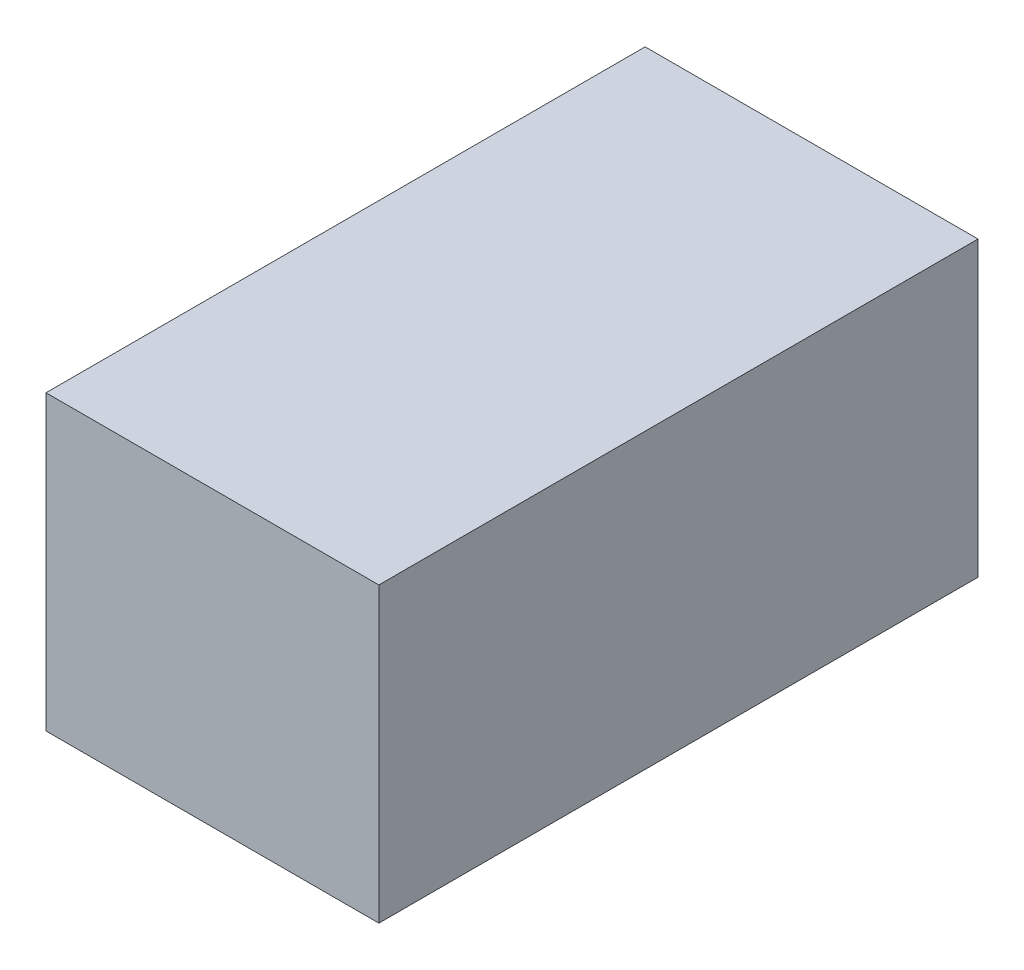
ISO-10303-21;
HEADER;
FILE_DESCRIPTION(('STEP AP214'),'2;1');
FILE_NAME('part.step','',(''),(''),'','','');
FILE_SCHEMA(('AUTOMOTIVE_DESIGN { 1 0 10303 214 1 1 1 1 }'));
ENDSEC;
DATA;
#1=APPLICATION_CONTEXT('core data for automotive mechanical design processes');
#2=APPLICATION_PROTOCOL_DEFINITION('international standard','automotive_design',2000,#1);
#3=PRODUCT_CONTEXT('',#1,'mechanical');
#4=PRODUCT('Part','Part','',(#3));
#5=PRODUCT_RELATED_PRODUCT_CATEGORY('part','',(#4));
#6=PRODUCT_DEFINITION_FORMATION('','',#4);
#7=PRODUCT_DEFINITION_CONTEXT('part definition',#1,'design');
#8=PRODUCT_DEFINITION('design','',#6,#7);
#9=PRODUCT_DEFINITION_SHAPE('','',#8);
#10=(LENGTH_UNIT() NAMED_UNIT(*) SI_UNIT(.MILLI.,.METRE.));
#11=(NAMED_UNIT(*) PLANE_ANGLE_UNIT() SI_UNIT($,.RADIAN.));
#12=(NAMED_UNIT(*) SI_UNIT($,.STERADIAN.) SOLID_ANGLE_UNIT());
#13=UNCERTAINTY_MEASURE_WITH_UNIT(LENGTH_MEASURE(1.E-05),#10,'distance_accuracy_value','');
#14=(GEOMETRIC_REPRESENTATION_CONTEXT(3) GLOBAL_UNCERTAINTY_ASSIGNED_CONTEXT((#13)) GLOBAL_UNIT_ASSIGNED_CONTEXT((#10,
#11,#12)) REPRESENTATION_CONTEXT('',''));
#15=CARTESIAN_POINT('',(0.,0.,0.));
#16=DIRECTION('',(0.,0.,1.));
#17=DIRECTION('',(1.,0.,0.));
#18=AXIS2_PLACEMENT_3D('',#15,#16,#17);
#19=CARTESIAN_POINT('',(32.1945,-2.794,-40.8813));
#20=DIRECTION('',(0.,-1.,0.));
#21=DIRECTION('',(0.,0.,1.));
#22=AXIS2_PLACEMENT_3D('',#19,#20,#21);
#23=PLANE('',#22);
#24=DIRECTION('',(1.,0.,0.));
#25=VECTOR('',#24,1.);
#26=CARTESIAN_POINT('',(30.5435,-2.794,-35.052));
#27=LINE('',#26,#25);
#28=CARTESIAN_POINT('',(28.956,-2.794,-35.052));
#29=VERTEX_POINT('',#28);
#30=CARTESIAN_POINT('',(32.131,-2.794,-35.052));
#31=VERTEX_POINT('',#30);
#32=EDGE_CURVE('E52',#29,#31,#27,.T.);
#33=ORIENTED_EDGE('',*,*,#32,.F.);
#34=DIRECTION('',(0.,0.,1.));
#35=VECTOR('',#34,1.);
#36=CARTESIAN_POINT('',(28.956,-2.794,-37.9095));
#37=LINE('',#36,#35);
#38=CARTESIAN_POINT('',(28.956,-2.794,-40.767));
#39=VERTEX_POINT('',#38);
#40=EDGE_CURVE('E67',#39,#29,#37,.T.);
#41=ORIENTED_EDGE('',*,*,#40,.F.);
#42=DIRECTION('',(-1.,0.,0.));
#43=VECTOR('',#42,1.);
#44=CARTESIAN_POINT('',(30.5435,-2.794,-40.767));
#45=LINE('',#44,#43);
#46=CARTESIAN_POINT('',(32.131,-2.794,-40.767));
#47=VERTEX_POINT('',#46);
#48=EDGE_CURVE('E19',#47,#39,#45,.T.);
#49=ORIENTED_EDGE('',*,*,#48,.F.);
#50=DIRECTION('',(0.,0.,-1.));
#51=VECTOR('',#50,1.);
#52=CARTESIAN_POINT('',(32.131,-2.794,-37.9095));
#53=LINE('',#52,#51);
#54=EDGE_CURVE('E57',#31,#47,#53,.T.);
#55=ORIENTED_EDGE('',*,*,#54,.F.);
#56=EDGE_LOOP('',(#33,#41,#49,#55));
#57=FACE_BOUND('',#56,.T.);
#58=ADVANCED_FACE('F15',(#57),#23,.T.);
#59=CARTESIAN_POINT('',(28.8925,0.05588,-40.767));
#60=DIRECTION('',(0.,0.,-1.));
#61=DIRECTION('',(1.,0.,0.));
#62=AXIS2_PLACEMENT_3D('',#59,#60,#61);
#63=PLANE('',#62);
#64=ORIENTED_EDGE('',*,*,#48,.T.);
#65=DIRECTION('',(0.,-1.,0.));
#66=VECTOR('',#65,1.);
#67=CARTESIAN_POINT('',(28.956,-1.397,-40.767));
#68=LINE('',#67,#66);
#69=CARTESIAN_POINT('',(28.956,0.,-40.767));
#70=VERTEX_POINT('',#69);
#71=EDGE_CURVE('E78',#70,#39,#68,.T.);
#72=ORIENTED_EDGE('',*,*,#71,.F.);
#73=DIRECTION('',(1.,0.,0.));
#74=VECTOR('',#73,1.);
#75=CARTESIAN_POINT('',(30.5435,0.,-40.767));
#76=LINE('',#75,#74);
#77=CARTESIAN_POINT('',(32.131,0.,-40.767));
#78=VERTEX_POINT('',#77);
#79=EDGE_CURVE('E73',#70,#78,#76,.T.);
#80=ORIENTED_EDGE('',*,*,#79,.T.);
#81=DIRECTION('',(0.,1.,0.));
#82=VECTOR('',#81,1.);
#83=CARTESIAN_POINT('',(32.131,-1.397,-40.767));
#84=LINE('',#83,#82);
#85=EDGE_CURVE('E62',#47,#78,#84,.T.);
#86=ORIENTED_EDGE('',*,*,#85,.F.);
#87=EDGE_LOOP('',(#64,#72,#80,#86));
#88=FACE_BOUND('',#87,.T.);
#89=ADVANCED_FACE('F72',(#88),#63,.T.);
#90=CARTESIAN_POINT('',(32.131,0.05588,-40.8813));
#91=DIRECTION('',(1.,0.,0.));
#92=DIRECTION('',(0.,0.,1.));
#93=AXIS2_PLACEMENT_3D('',#90,#91,#92);
#94=PLANE('',#93);
#95=ORIENTED_EDGE('',*,*,#54,.T.);
#96=ORIENTED_EDGE('',*,*,#85,.T.);
#97=DIRECTION('',(0.,0.,1.));
#98=VECTOR('',#97,1.);
#99=CARTESIAN_POINT('',(32.131,0.,-37.9095));
#100=LINE('',#99,#98);
#101=CARTESIAN_POINT('',(32.131,0.,-35.052));
#102=VERTEX_POINT('',#101);
#103=EDGE_CURVE('E83',#78,#102,#100,.T.);
#104=ORIENTED_EDGE('',*,*,#103,.T.);
#105=DIRECTION('',(0.,1.,0.));
#106=VECTOR('',#105,1.);
#107=CARTESIAN_POINT('',(32.131,-1.397,-35.052));
#108=LINE('',#107,#106);
#109=EDGE_CURVE('E64',#31,#102,#108,.T.);
#110=ORIENTED_EDGE('',*,*,#109,.F.);
#111=EDGE_LOOP('',(#95,#96,#104,#110));
#112=FACE_BOUND('',#111,.T.);
#113=ADVANCED_FACE('F59',(#112),#94,.T.);
#114=CARTESIAN_POINT('',(32.1945,0.05588,-35.052));
#115=DIRECTION('',(0.,0.,1.));
#116=DIRECTION('',(-1.,0.,0.));
#117=AXIS2_PLACEMENT_3D('',#114,#115,#116);
#118=PLANE('',#117);
#119=ORIENTED_EDGE('',*,*,#32,.T.);
#120=ORIENTED_EDGE('',*,*,#109,.T.);
#121=DIRECTION('',(-1.,0.,0.));
#122=VECTOR('',#121,1.);
#123=CARTESIAN_POINT('',(30.5435,0.,-35.052));
#124=LINE('',#123,#122);
#125=CARTESIAN_POINT('',(28.956,0.,-35.052));
#126=VERTEX_POINT('',#125);
#127=EDGE_CURVE('E25',#102,#126,#124,.T.);
#128=ORIENTED_EDGE('',*,*,#127,.T.);
#129=DIRECTION('',(0.,1.,0.));
#130=VECTOR('',#129,1.);
#131=CARTESIAN_POINT('',(28.956,-1.397,-35.052));
#132=LINE('',#131,#130);
#133=EDGE_CURVE('E33',#29,#126,#132,.T.);
#134=ORIENTED_EDGE('',*,*,#133,.F.);
#135=EDGE_LOOP('',(#119,#120,#128,#134));
#136=FACE_BOUND('',#135,.T.);
#137=ADVANCED_FACE('F87',(#136),#118,.T.);
#138=CARTESIAN_POINT('',(28.956,0.05588,-34.9377));
#139=DIRECTION('',(-1.,0.,0.));
#140=DIRECTION('',(0.,0.,-1.));
#141=AXIS2_PLACEMENT_3D('',#138,#139,#140);
#142=PLANE('',#141);
#143=ORIENTED_EDGE('',*,*,#40,.T.);
#144=ORIENTED_EDGE('',*,*,#133,.T.);
#145=DIRECTION('',(0.,0.,-1.));
#146=VECTOR('',#145,1.);
#147=CARTESIAN_POINT('',(28.956,0.,-37.9095));
#148=LINE('',#147,#146);
#149=EDGE_CURVE('E10',#126,#70,#148,.T.);
#150=ORIENTED_EDGE('',*,*,#149,.T.);
#151=ORIENTED_EDGE('',*,*,#71,.T.);
#152=EDGE_LOOP('',(#143,#144,#150,#151));
#153=FACE_BOUND('',#152,.T.);
#154=ADVANCED_FACE('F89',(#153),#142,.T.);
#155=CARTESIAN_POINT('',(32.1945,0.,-40.8813));
#156=DIRECTION('',(0.,-1.,0.));
#157=DIRECTION('',(0.,0.,1.));
#158=AXIS2_PLACEMENT_3D('',#155,#156,#157);
#159=PLANE('',#158);
#160=ORIENTED_EDGE('',*,*,#127,.F.);
#161=ORIENTED_EDGE('',*,*,#103,.F.);
#162=ORIENTED_EDGE('',*,*,#79,.F.);
#163=ORIENTED_EDGE('',*,*,#149,.F.);
#164=EDGE_LOOP('',(#160,#161,#162,#163));
#165=FACE_BOUND('',#164,.T.);
#166=ADVANCED_FACE('F17',(#165),#159,.F.);
#167=CLOSED_SHELL('',(#58,#89,#113,#137,#154,#166));
#168=MANIFOLD_SOLID_BREP('B1',#167);
#169=ADVANCED_BREP_SHAPE_REPRESENTATION('',(#18,#168),#14);
#170=SHAPE_DEFINITION_REPRESENTATION(#9,#169);
ENDSEC;
END-ISO-10303-21;
